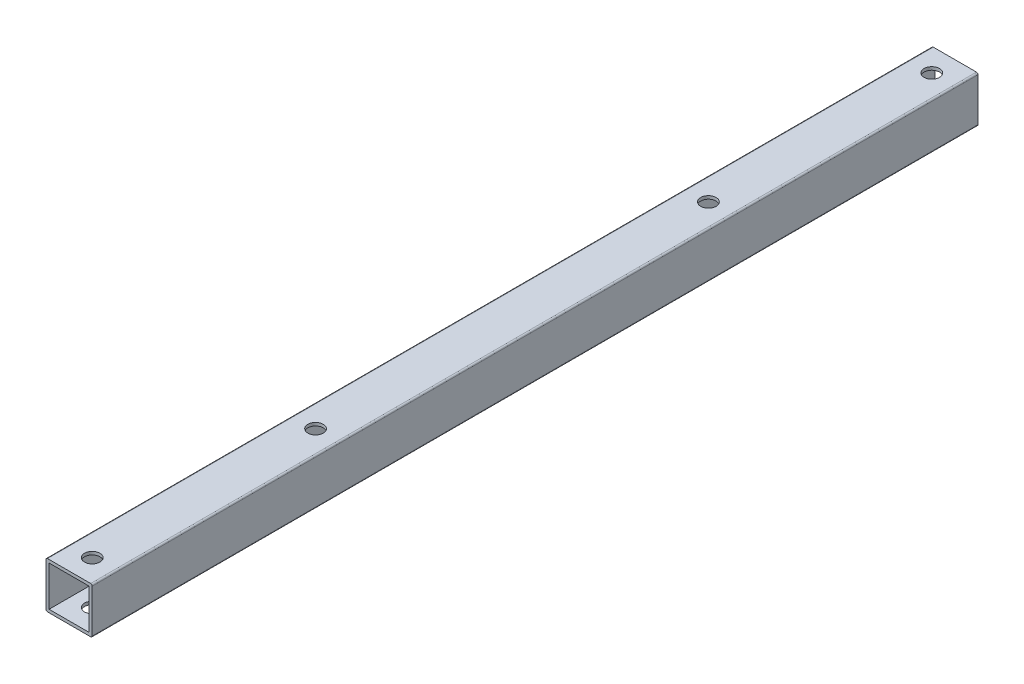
ISO-10303-21;
HEADER;
FILE_DESCRIPTION(('STEP AP214'),'2;1');
FILE_NAME('part.step','',(''),(''),'','','');
FILE_SCHEMA(('AUTOMOTIVE_DESIGN { 1 0 10303 214 1 1 1 1 }'));
ENDSEC;
DATA;
#1=APPLICATION_CONTEXT('core data for automotive mechanical design processes');
#2=APPLICATION_PROTOCOL_DEFINITION('international standard','automotive_design',2000,#1);
#3=PRODUCT_CONTEXT('',#1,'mechanical');
#4=PRODUCT('Part','Part','',(#3));
#5=PRODUCT_RELATED_PRODUCT_CATEGORY('part','',(#4));
#6=PRODUCT_DEFINITION_FORMATION('','',#4);
#7=PRODUCT_DEFINITION_CONTEXT('part definition',#1,'design');
#8=PRODUCT_DEFINITION('design','',#6,#7);
#9=PRODUCT_DEFINITION_SHAPE('','',#8);
#10=(LENGTH_UNIT() NAMED_UNIT(*) SI_UNIT(.MILLI.,.METRE.));
#11=(NAMED_UNIT(*) PLANE_ANGLE_UNIT() SI_UNIT($,.RADIAN.));
#12=(NAMED_UNIT(*) SI_UNIT($,.STERADIAN.) SOLID_ANGLE_UNIT());
#13=UNCERTAINTY_MEASURE_WITH_UNIT(LENGTH_MEASURE(1.E-05),#10,'distance_accuracy_value','');
#14=(GEOMETRIC_REPRESENTATION_CONTEXT(3) GLOBAL_UNCERTAINTY_ASSIGNED_CONTEXT((#13)) GLOBAL_UNIT_ASSIGNED_CONTEXT((#10,
#11,#12)) REPRESENTATION_CONTEXT('',''));
#15=CARTESIAN_POINT('',(0.,0.,0.));
#16=DIRECTION('',(0.,0.,1.));
#17=DIRECTION('',(1.,0.,0.));
#18=AXIS2_PLACEMENT_3D('',#15,#16,#17);
#19=CARTESIAN_POINT('',(-14.,-14.,0.));
#20=DIRECTION('',(0.,0.,-1.));
#21=DIRECTION('',(-1.,0.,0.));
#22=AXIS2_PLACEMENT_3D('',#19,#20,#21);
#23=PLANE('',#22);
#24=CARTESIAN_POINT('',(-14.,-14.,0.));
#25=DIRECTION('',(0.,0.,-1.));
#26=DIRECTION('',(-1.,0.,0.));
#27=AXIS2_PLACEMENT_3D('',#24,#25,#26);
#28=CIRCLE('',#27,0.999999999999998);
#29=CARTESIAN_POINT('',(-14.,-15.,0.));
#30=VERTEX_POINT('',#29);
#31=CARTESIAN_POINT('',(-15.,-14.,0.));
#32=VERTEX_POINT('',#31);
#33=EDGE_CURVE('E127',#30,#32,#28,.T.);
#34=ORIENTED_EDGE('',*,*,#33,.T.);
#35=DIRECTION('',(0.,-1.,0.));
#36=VECTOR('',#35,1.);
#37=CARTESIAN_POINT('',(-15.,14.,0.));
#38=LINE('',#37,#36);
#39=CARTESIAN_POINT('',(-15.,14.,0.));
#40=VERTEX_POINT('',#39);
#41=EDGE_CURVE('E163',#40,#32,#38,.T.);
#42=ORIENTED_EDGE('',*,*,#41,.F.);
#43=CARTESIAN_POINT('',(-14.,14.,0.));
#44=DIRECTION('',(0.,0.,-1.));
#45=DIRECTION('',(-1.,0.,0.));
#46=AXIS2_PLACEMENT_3D('',#43,#44,#45);
#47=CIRCLE('',#46,0.999999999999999);
#48=CARTESIAN_POINT('',(-14.,15.,0.));
#49=VERTEX_POINT('',#48);
#50=EDGE_CURVE('E166',#40,#49,#47,.T.);
#51=ORIENTED_EDGE('',*,*,#50,.T.);
#52=DIRECTION('',(1.,0.,0.));
#53=VECTOR('',#52,1.);
#54=CARTESIAN_POINT('',(-14.,15.,0.));
#55=LINE('',#54,#53);
#56=CARTESIAN_POINT('',(14.,15.,0.));
#57=VERTEX_POINT('',#56);
#58=EDGE_CURVE('E169',#49,#57,#55,.T.);
#59=ORIENTED_EDGE('',*,*,#58,.T.);
#60=CARTESIAN_POINT('',(14.,14.,0.));
#61=DIRECTION('',(0.,0.,1.));
#62=DIRECTION('',(1.,0.,0.));
#63=AXIS2_PLACEMENT_3D('',#60,#61,#62);
#64=CIRCLE('',#63,0.999999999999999);
#65=CARTESIAN_POINT('',(15.,14.,0.));
#66=VERTEX_POINT('',#65);
#67=EDGE_CURVE('E172',#66,#57,#64,.T.);
#68=ORIENTED_EDGE('',*,*,#67,.F.);
#69=DIRECTION('',(0.,1.,0.));
#70=VECTOR('',#69,1.);
#71=CARTESIAN_POINT('',(15.,-14.,0.));
#72=LINE('',#71,#70);
#73=CARTESIAN_POINT('',(15.,-14.,0.));
#74=VERTEX_POINT('',#73);
#75=EDGE_CURVE('E175',#74,#66,#72,.T.);
#76=ORIENTED_EDGE('',*,*,#75,.F.);
#77=CARTESIAN_POINT('',(14.,-14.,0.));
#78=DIRECTION('',(0.,0.,-1.));
#79=DIRECTION('',(-1.,0.,0.));
#80=AXIS2_PLACEMENT_3D('',#77,#78,#79);
#81=CIRCLE('',#80,1.);
#82=CARTESIAN_POINT('',(14.,-15.,0.));
#83=VERTEX_POINT('',#82);
#84=EDGE_CURVE('E177',#74,#83,#81,.T.);
#85=ORIENTED_EDGE('',*,*,#84,.T.);
#86=DIRECTION('',(-1.,0.,0.));
#87=VECTOR('',#86,1.);
#88=CARTESIAN_POINT('',(14.,-15.,0.));
#89=LINE('',#88,#87);
#90=EDGE_CURVE('E180',#83,#30,#89,.T.);
#91=ORIENTED_EDGE('',*,*,#90,.T.);
#92=EDGE_LOOP('',(#34,#42,#51,#59,#68,#76,#85,#91));
#93=FACE_BOUND('',#92,.T.);
#94=DIRECTION('',(1.,0.,0.));
#95=VECTOR('',#94,1.);
#96=CARTESIAN_POINT('',(-14.,13.,0.));
#97=LINE('',#96,#95);
#98=CARTESIAN_POINT('',(-13.,13.,0.));
#99=VERTEX_POINT('',#98);
#100=CARTESIAN_POINT('',(13.,13.,0.));
#101=VERTEX_POINT('',#100);
#102=EDGE_CURVE('E140',#99,#101,#97,.T.);
#103=ORIENTED_EDGE('',*,*,#102,.F.);
#104=DIRECTION('',(0.,-1.,0.));
#105=VECTOR('',#104,1.);
#106=CARTESIAN_POINT('',(-13.,-14.,0.));
#107=LINE('',#106,#105);
#108=CARTESIAN_POINT('',(-13.,-13.,0.));
#109=VERTEX_POINT('',#108);
#110=EDGE_CURVE('E47',#99,#109,#107,.T.);
#111=ORIENTED_EDGE('',*,*,#110,.T.);
#112=DIRECTION('',(-1.,0.,0.));
#113=VECTOR('',#112,1.);
#114=CARTESIAN_POINT('',(-14.,-13.,0.));
#115=LINE('',#114,#113);
#116=CARTESIAN_POINT('',(13.,-13.,0.));
#117=VERTEX_POINT('',#116);
#118=EDGE_CURVE('E131',#117,#109,#115,.T.);
#119=ORIENTED_EDGE('',*,*,#118,.F.);
#120=DIRECTION('',(0.,1.,0.));
#121=VECTOR('',#120,1.);
#122=CARTESIAN_POINT('',(13.,-14.,0.));
#123=LINE('',#122,#121);
#124=EDGE_CURVE('E136',#117,#101,#123,.T.);
#125=ORIENTED_EDGE('',*,*,#124,.T.);
#126=EDGE_LOOP('',(#103,#111,#119,#125));
#127=FACE_BOUND('',#126,.T.);
#128=ADVANCED_FACE('F30',(#93,#127),#23,.T.);
#129=CARTESIAN_POINT('',(-14.,-14.,575.));
#130=DIRECTION('',(0.,0.,-1.));
#131=DIRECTION('',(-1.,0.,0.));
#132=AXIS2_PLACEMENT_3D('',#129,#130,#131);
#133=CYLINDRICAL_SURFACE('',#132,0.999999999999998);
#134=ORIENTED_EDGE('',*,*,#33,.F.);
#135=DIRECTION('',(0.,0.,-1.));
#136=VECTOR('',#135,1.);
#137=CARTESIAN_POINT('',(-14.,-15.,575.));
#138=LINE('',#137,#136);
#139=CARTESIAN_POINT('',(-14.,-15.,575.));
#140=VERTEX_POINT('',#139);
#141=EDGE_CURVE('E11',#140,#30,#138,.T.);
#142=ORIENTED_EDGE('',*,*,#141,.F.);
#143=CARTESIAN_POINT('',(-14.,-14.,575.));
#144=DIRECTION('',(0.,0.,-1.));
#145=DIRECTION('',(-1.,0.,0.));
#146=AXIS2_PLACEMENT_3D('',#143,#144,#145);
#147=CIRCLE('',#146,0.999999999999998);
#148=CARTESIAN_POINT('',(-15.,-14.,575.));
#149=VERTEX_POINT('',#148);
#150=EDGE_CURVE('E183',#140,#149,#147,.T.);
#151=ORIENTED_EDGE('',*,*,#150,.T.);
#152=DIRECTION('',(0.,0.,-1.));
#153=VECTOR('',#152,1.);
#154=CARTESIAN_POINT('',(-15.,-14.,575.));
#155=LINE('',#154,#153);
#156=EDGE_CURVE('E203',#149,#32,#155,.T.);
#157=ORIENTED_EDGE('',*,*,#156,.T.);
#158=EDGE_LOOP('',(#134,#142,#151,#157));
#159=FACE_BOUND('',#158,.T.);
#160=ADVANCED_FACE('F32',(#159),#133,.T.);
#161=CARTESIAN_POINT('',(14.,-15.,575.));
#162=DIRECTION('',(0.,-1.,0.));
#163=DIRECTION('',(1.,0.,0.));
#164=AXIS2_PLACEMENT_3D('',#161,#162,#163);
#165=PLANE('',#164);
#166=CARTESIAN_POINT('',(0.,-15.,415.));
#167=DIRECTION('',(0.,-1.,0.));
#168=DIRECTION('',(1.,0.,0.));
#169=AXIS2_PLACEMENT_3D('',#166,#167,#168);
#170=CIRCLE('',#169,5.);
#171=CARTESIAN_POINT('',(5.,-15.,415.));
#172=VERTEX_POINT('',#171);
#173=EDGE_CURVE('E236',#172,#172,#170,.T.);
#174=ORIENTED_EDGE('',*,*,#173,.F.);
#175=EDGE_LOOP('',(#174));
#176=FACE_BOUND('',#175,.T.);
#177=CARTESIAN_POINT('',(0.,-15.,560.));
#178=DIRECTION('',(0.,-1.,0.));
#179=DIRECTION('',(1.,0.,0.));
#180=AXIS2_PLACEMENT_3D('',#177,#178,#179);
#181=CIRCLE('',#180,5.);
#182=CARTESIAN_POINT('',(5.,-15.,560.));
#183=VERTEX_POINT('',#182);
#184=EDGE_CURVE('E233',#183,#183,#181,.T.);
#185=ORIENTED_EDGE('',*,*,#184,.F.);
#186=EDGE_LOOP('',(#185));
#187=FACE_BOUND('',#186,.T.);
#188=CARTESIAN_POINT('',(0.,-15.,160.));
#189=DIRECTION('',(0.,-1.,0.));
#190=DIRECTION('',(1.,0.,0.));
#191=AXIS2_PLACEMENT_3D('',#188,#189,#190);
#192=CIRCLE('',#191,5.);
#193=CARTESIAN_POINT('',(5.,-15.,160.));
#194=VERTEX_POINT('',#193);
#195=EDGE_CURVE('E251',#194,#194,#192,.T.);
#196=ORIENTED_EDGE('',*,*,#195,.F.);
#197=EDGE_LOOP('',(#196));
#198=FACE_BOUND('',#197,.T.);
#199=CARTESIAN_POINT('',(0.,-15.,15.));
#200=DIRECTION('',(0.,-1.,0.));
#201=DIRECTION('',(1.,0.,0.));
#202=AXIS2_PLACEMENT_3D('',#199,#200,#201);
#203=CIRCLE('',#202,5.);
#204=CARTESIAN_POINT('',(5.,-15.,15.));
#205=VERTEX_POINT('',#204);
#206=EDGE_CURVE('E141',#205,#205,#203,.T.);
#207=ORIENTED_EDGE('',*,*,#206,.F.);
#208=EDGE_LOOP('',(#207));
#209=FACE_BOUND('',#208,.T.);
#210=ORIENTED_EDGE('',*,*,#90,.F.);
#211=DIRECTION('',(0.,0.,-1.));
#212=VECTOR('',#211,1.);
#213=CARTESIAN_POINT('',(14.,-15.,575.));
#214=LINE('',#213,#212);
#215=CARTESIAN_POINT('',(14.,-15.,575.));
#216=VERTEX_POINT('',#215);
#217=EDGE_CURVE('E39',#216,#83,#214,.T.);
#218=ORIENTED_EDGE('',*,*,#217,.F.);
#219=DIRECTION('',(-1.,0.,0.));
#220=VECTOR('',#219,1.);
#221=CARTESIAN_POINT('',(14.,-15.,575.));
#222=LINE('',#221,#220);
#223=EDGE_CURVE('E201',#216,#140,#222,.T.);
#224=ORIENTED_EDGE('',*,*,#223,.T.);
#225=ORIENTED_EDGE('',*,*,#141,.T.);
#226=EDGE_LOOP('',(#210,#218,#224,#225));
#227=FACE_BOUND('',#226,.T.);
#228=ADVANCED_FACE('F281',(#176,#187,#198,#209,#227),#165,.T.);
#229=CARTESIAN_POINT('',(14.,-14.,575.));
#230=DIRECTION('',(0.,0.,-1.));
#231=DIRECTION('',(-1.,0.,0.));
#232=AXIS2_PLACEMENT_3D('',#229,#230,#231);
#233=CYLINDRICAL_SURFACE('',#232,1.);
#234=ORIENTED_EDGE('',*,*,#84,.F.);
#235=DIRECTION('',(0.,0.,-1.));
#236=VECTOR('',#235,1.);
#237=CARTESIAN_POINT('',(15.,-14.,575.));
#238=LINE('',#237,#236);
#239=CARTESIAN_POINT('',(15.,-14.,575.));
#240=VERTEX_POINT('',#239);
#241=EDGE_CURVE('E206',#240,#74,#238,.T.);
#242=ORIENTED_EDGE('',*,*,#241,.F.);
#243=CARTESIAN_POINT('',(14.,-14.,575.));
#244=DIRECTION('',(0.,0.,-1.));
#245=DIRECTION('',(-1.,0.,0.));
#246=AXIS2_PLACEMENT_3D('',#243,#244,#245);
#247=CIRCLE('',#246,1.);
#248=EDGE_CURVE('E198',#240,#216,#247,.T.);
#249=ORIENTED_EDGE('',*,*,#248,.T.);
#250=ORIENTED_EDGE('',*,*,#217,.T.);
#251=EDGE_LOOP('',(#234,#242,#249,#250));
#252=FACE_BOUND('',#251,.T.);
#253=ADVANCED_FACE('F293',(#252),#233,.T.);
#254=CARTESIAN_POINT('',(15.,-14.,575.));
#255=DIRECTION('',(-1.,0.,0.));
#256=DIRECTION('',(0.,-1.,0.));
#257=AXIS2_PLACEMENT_3D('',#254,#255,#256);
#258=PLANE('',#257);
#259=ORIENTED_EDGE('',*,*,#75,.T.);
#260=DIRECTION('',(0.,0.,-1.));
#261=VECTOR('',#260,1.);
#262=CARTESIAN_POINT('',(15.,14.,575.));
#263=LINE('',#262,#261);
#264=CARTESIAN_POINT('',(15.,14.,575.));
#265=VERTEX_POINT('',#264);
#266=EDGE_CURVE('E208',#265,#66,#263,.T.);
#267=ORIENTED_EDGE('',*,*,#266,.F.);
#268=DIRECTION('',(0.,1.,0.));
#269=VECTOR('',#268,1.);
#270=CARTESIAN_POINT('',(15.,-14.,575.));
#271=LINE('',#270,#269);
#272=EDGE_CURVE('E196',#240,#265,#271,.T.);
#273=ORIENTED_EDGE('',*,*,#272,.F.);
#274=ORIENTED_EDGE('',*,*,#241,.T.);
#275=EDGE_LOOP('',(#259,#267,#273,#274));
#276=FACE_BOUND('',#275,.T.);
#277=ADVANCED_FACE('F297',(#276),#258,.F.);
#278=CARTESIAN_POINT('',(14.,14.,575.));
#279=DIRECTION('',(0.,0.,-1.));
#280=DIRECTION('',(-1.,0.,0.));
#281=AXIS2_PLACEMENT_3D('',#278,#279,#280);
#282=CYLINDRICAL_SURFACE('',#281,0.999999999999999);
#283=ORIENTED_EDGE('',*,*,#67,.T.);
#284=DIRECTION('',(0.,0.,-1.));
#285=VECTOR('',#284,1.);
#286=CARTESIAN_POINT('',(14.,15.,575.));
#287=LINE('',#286,#285);
#288=CARTESIAN_POINT('',(14.,15.,575.));
#289=VERTEX_POINT('',#288);
#290=EDGE_CURVE('E211',#289,#57,#287,.T.);
#291=ORIENTED_EDGE('',*,*,#290,.F.);
#292=CARTESIAN_POINT('',(14.,14.,575.));
#293=DIRECTION('',(0.,0.,1.));
#294=DIRECTION('',(1.,0.,0.));
#295=AXIS2_PLACEMENT_3D('',#292,#293,#294);
#296=CIRCLE('',#295,0.999999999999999);
#297=EDGE_CURVE('E194',#265,#289,#296,.T.);
#298=ORIENTED_EDGE('',*,*,#297,.F.);
#299=ORIENTED_EDGE('',*,*,#266,.T.);
#300=EDGE_LOOP('',(#283,#291,#298,#299));
#301=FACE_BOUND('',#300,.T.);
#302=ADVANCED_FACE('F301',(#301),#282,.T.);
#303=CARTESIAN_POINT('',(-14.,15.,575.));
#304=DIRECTION('',(0.,1.,0.));
#305=DIRECTION('',(0.,0.,1.));
#306=AXIS2_PLACEMENT_3D('',#303,#304,#305);
#307=PLANE('',#306);
#308=CARTESIAN_POINT('',(0.,15.,415.));
#309=DIRECTION('',(0.,1.,0.));
#310=DIRECTION('',(0.,0.,1.));
#311=AXIS2_PLACEMENT_3D('',#308,#309,#310);
#312=CIRCLE('',#311,5.);
#313=CARTESIAN_POINT('',(0.,15.,420.));
#314=VERTEX_POINT('',#313);
#315=EDGE_CURVE('E440',#314,#314,#312,.T.);
#316=ORIENTED_EDGE('',*,*,#315,.F.);
#317=EDGE_LOOP('',(#316));
#318=FACE_BOUND('',#317,.T.);
#319=CARTESIAN_POINT('',(0.,15.,560.));
#320=DIRECTION('',(0.,1.,0.));
#321=DIRECTION('',(0.,0.,1.));
#322=AXIS2_PLACEMENT_3D('',#319,#320,#321);
#323=CIRCLE('',#322,5.);
#324=CARTESIAN_POINT('',(0.,15.,565.));
#325=VERTEX_POINT('',#324);
#326=EDGE_CURVE('E229',#325,#325,#323,.T.);
#327=ORIENTED_EDGE('',*,*,#326,.F.);
#328=EDGE_LOOP('',(#327));
#329=FACE_BOUND('',#328,.T.);
#330=CARTESIAN_POINT('',(0.,15.,160.));
#331=DIRECTION('',(0.,1.,0.));
#332=DIRECTION('',(0.,0.,1.));
#333=AXIS2_PLACEMENT_3D('',#330,#331,#332);
#334=CIRCLE('',#333,5.);
#335=CARTESIAN_POINT('',(0.,15.,165.));
#336=VERTEX_POINT('',#335);
#337=EDGE_CURVE('E225',#336,#336,#334,.T.);
#338=ORIENTED_EDGE('',*,*,#337,.F.);
#339=EDGE_LOOP('',(#338));
#340=FACE_BOUND('',#339,.T.);
#341=CARTESIAN_POINT('',(0.,15.,15.));
#342=DIRECTION('',(0.,1.,0.));
#343=DIRECTION('',(0.,0.,1.));
#344=AXIS2_PLACEMENT_3D('',#341,#342,#343);
#345=CIRCLE('',#344,5.);
#346=CARTESIAN_POINT('',(0.,15.,20.));
#347=VERTEX_POINT('',#346);
#348=EDGE_CURVE('E221',#347,#347,#345,.T.);
#349=ORIENTED_EDGE('',*,*,#348,.F.);
#350=EDGE_LOOP('',(#349));
#351=FACE_BOUND('',#350,.T.);
#352=ORIENTED_EDGE('',*,*,#58,.F.);
#353=DIRECTION('',(0.,0.,-1.));
#354=VECTOR('',#353,1.);
#355=CARTESIAN_POINT('',(-14.,15.,575.));
#356=LINE('',#355,#354);
#357=CARTESIAN_POINT('',(-14.,15.,575.));
#358=VERTEX_POINT('',#357);
#359=EDGE_CURVE('E213',#358,#49,#356,.T.);
#360=ORIENTED_EDGE('',*,*,#359,.F.);
#361=DIRECTION('',(1.,0.,0.));
#362=VECTOR('',#361,1.);
#363=CARTESIAN_POINT('',(-14.,15.,575.));
#364=LINE('',#363,#362);
#365=EDGE_CURVE('E191',#358,#289,#364,.T.);
#366=ORIENTED_EDGE('',*,*,#365,.T.);
#367=ORIENTED_EDGE('',*,*,#290,.T.);
#368=EDGE_LOOP('',(#352,#360,#366,#367));
#369=FACE_BOUND('',#368,.T.);
#370=ADVANCED_FACE('F305',(#318,#329,#340,#351,#369),#307,.T.);
#371=CARTESIAN_POINT('',(-14.,14.,575.));
#372=DIRECTION('',(0.,0.,-1.));
#373=DIRECTION('',(-1.,0.,0.));
#374=AXIS2_PLACEMENT_3D('',#371,#372,#373);
#375=CYLINDRICAL_SURFACE('',#374,0.999999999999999);
#376=ORIENTED_EDGE('',*,*,#50,.F.);
#377=DIRECTION('',(0.,0.,-1.));
#378=VECTOR('',#377,1.);
#379=CARTESIAN_POINT('',(-15.,14.,575.));
#380=LINE('',#379,#378);
#381=CARTESIAN_POINT('',(-15.,14.,575.));
#382=VERTEX_POINT('',#381);
#383=EDGE_CURVE('E215',#382,#40,#380,.T.);
#384=ORIENTED_EDGE('',*,*,#383,.F.);
#385=CARTESIAN_POINT('',(-14.,14.,575.));
#386=DIRECTION('',(0.,0.,-1.));
#387=DIRECTION('',(-1.,0.,0.));
#388=AXIS2_PLACEMENT_3D('',#385,#386,#387);
#389=CIRCLE('',#388,0.999999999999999);
#390=EDGE_CURVE('E188',#382,#358,#389,.T.);
#391=ORIENTED_EDGE('',*,*,#390,.T.);
#392=ORIENTED_EDGE('',*,*,#359,.T.);
#393=EDGE_LOOP('',(#376,#384,#391,#392));
#394=FACE_BOUND('',#393,.T.);
#395=ADVANCED_FACE('F309',(#394),#375,.T.);
#396=CARTESIAN_POINT('',(-15.,14.,575.));
#397=DIRECTION('',(1.,0.,0.));
#398=DIRECTION('',(0.,1.,0.));
#399=AXIS2_PLACEMENT_3D('',#396,#397,#398);
#400=PLANE('',#399);
#401=ORIENTED_EDGE('',*,*,#41,.T.);
#402=ORIENTED_EDGE('',*,*,#156,.F.);
#403=DIRECTION('',(0.,-1.,0.));
#404=VECTOR('',#403,1.);
#405=CARTESIAN_POINT('',(-15.,14.,575.));
#406=LINE('',#405,#404);
#407=EDGE_CURVE('E186',#382,#149,#406,.T.);
#408=ORIENTED_EDGE('',*,*,#407,.F.);
#409=ORIENTED_EDGE('',*,*,#383,.T.);
#410=EDGE_LOOP('',(#401,#402,#408,#409));
#411=FACE_BOUND('',#410,.T.);
#412=ADVANCED_FACE('F289',(#411),#400,.F.);
#413=CARTESIAN_POINT('',(-14.,-14.,575.));
#414=DIRECTION('',(0.,0.,-1.));
#415=DIRECTION('',(-1.,0.,0.));
#416=AXIS2_PLACEMENT_3D('',#413,#414,#415);
#417=PLANE('',#416);
#418=DIRECTION('',(0.,1.,0.));
#419=VECTOR('',#418,1.);
#420=CARTESIAN_POINT('',(13.,-14.,575.));
#421=LINE('',#420,#419);
#422=CARTESIAN_POINT('',(13.,-13.,575.));
#423=VERTEX_POINT('',#422);
#424=CARTESIAN_POINT('',(13.,13.,575.));
#425=VERTEX_POINT('',#424);
#426=EDGE_CURVE('E153',#423,#425,#421,.T.);
#427=ORIENTED_EDGE('',*,*,#426,.F.);
#428=DIRECTION('',(-1.,0.,0.));
#429=VECTOR('',#428,1.);
#430=CARTESIAN_POINT('',(-14.,-13.,575.));
#431=LINE('',#430,#429);
#432=CARTESIAN_POINT('',(-13.,-13.,575.));
#433=VERTEX_POINT('',#432);
#434=EDGE_CURVE('E151',#423,#433,#431,.T.);
#435=ORIENTED_EDGE('',*,*,#434,.T.);
#436=DIRECTION('',(0.,-1.,0.));
#437=VECTOR('',#436,1.);
#438=CARTESIAN_POINT('',(-13.,-14.,575.));
#439=LINE('',#438,#437);
#440=CARTESIAN_POINT('',(-13.,13.,575.));
#441=VERTEX_POINT('',#440);
#442=EDGE_CURVE('E123',#441,#433,#439,.T.);
#443=ORIENTED_EDGE('',*,*,#442,.F.);
#444=DIRECTION('',(1.,0.,0.));
#445=VECTOR('',#444,1.);
#446=CARTESIAN_POINT('',(-14.,13.,575.));
#447=LINE('',#446,#445);
#448=EDGE_CURVE('E54',#441,#425,#447,.T.);
#449=ORIENTED_EDGE('',*,*,#448,.T.);
#450=EDGE_LOOP('',(#427,#435,#443,#449));
#451=FACE_BOUND('',#450,.T.);
#452=ORIENTED_EDGE('',*,*,#150,.F.);
#453=ORIENTED_EDGE('',*,*,#223,.F.);
#454=ORIENTED_EDGE('',*,*,#248,.F.);
#455=ORIENTED_EDGE('',*,*,#272,.T.);
#456=ORIENTED_EDGE('',*,*,#297,.T.);
#457=ORIENTED_EDGE('',*,*,#365,.F.);
#458=ORIENTED_EDGE('',*,*,#390,.F.);
#459=ORIENTED_EDGE('',*,*,#407,.T.);
#460=EDGE_LOOP('',(#452,#453,#454,#455,#456,#457,#458,#459));
#461=FACE_BOUND('',#460,.T.);
#462=ADVANCED_FACE('F286',(#451,#461),#417,.F.);
#463=CARTESIAN_POINT('',(-13.,-14.,575.));
#464=DIRECTION('',(1.,0.,0.));
#465=DIRECTION('',(0.,1.,0.));
#466=AXIS2_PLACEMENT_3D('',#463,#464,#465);
#467=PLANE('',#466);
#468=ORIENTED_EDGE('',*,*,#110,.F.);
#469=DIRECTION('',(0.,0.,-1.));
#470=VECTOR('',#469,1.);
#471=CARTESIAN_POINT('',(-13.,13.,575.));
#472=LINE('',#471,#470);
#473=EDGE_CURVE('E156',#441,#99,#472,.T.);
#474=ORIENTED_EDGE('',*,*,#473,.F.);
#475=ORIENTED_EDGE('',*,*,#442,.T.);
#476=DIRECTION('',(0.,0.,-1.));
#477=VECTOR('',#476,1.);
#478=CARTESIAN_POINT('',(-13.,-13.,575.));
#479=LINE('',#478,#477);
#480=EDGE_CURVE('E119',#433,#109,#479,.T.);
#481=ORIENTED_EDGE('',*,*,#480,.T.);
#482=EDGE_LOOP('',(#468,#474,#475,#481));
#483=FACE_BOUND('',#482,.T.);
#484=ADVANCED_FACE('F121',(#483),#467,.T.);
#485=CARTESIAN_POINT('',(-14.,-13.,575.));
#486=DIRECTION('',(0.,-1.,0.));
#487=DIRECTION('',(1.,0.,0.));
#488=AXIS2_PLACEMENT_3D('',#485,#486,#487);
#489=PLANE('',#488);
#490=CARTESIAN_POINT('',(0.,-13.,415.));
#491=DIRECTION('',(0.,-1.,0.));
#492=DIRECTION('',(1.,0.,0.));
#493=AXIS2_PLACEMENT_3D('',#490,#491,#492);
#494=CIRCLE('',#493,5.);
#495=CARTESIAN_POINT('',(5.,-13.,415.));
#496=VERTEX_POINT('',#495);
#497=EDGE_CURVE('E241',#496,#496,#494,.T.);
#498=ORIENTED_EDGE('',*,*,#497,.T.);
#499=EDGE_LOOP('',(#498));
#500=FACE_BOUND('',#499,.T.);
#501=CARTESIAN_POINT('',(0.,-13.,560.));
#502=DIRECTION('',(0.,-1.,0.));
#503=DIRECTION('',(1.,0.,0.));
#504=AXIS2_PLACEMENT_3D('',#501,#502,#503);
#505=CIRCLE('',#504,5.);
#506=CARTESIAN_POINT('',(5.,-13.,560.));
#507=VERTEX_POINT('',#506);
#508=EDGE_CURVE('E228',#507,#507,#505,.T.);
#509=ORIENTED_EDGE('',*,*,#508,.T.);
#510=EDGE_LOOP('',(#509));
#511=FACE_BOUND('',#510,.T.);
#512=CARTESIAN_POINT('',(0.,-13.,160.));
#513=DIRECTION('',(0.,-1.,0.));
#514=DIRECTION('',(1.,0.,0.));
#515=AXIS2_PLACEMENT_3D('',#512,#513,#514);
#516=CIRCLE('',#515,5.);
#517=CARTESIAN_POINT('',(5.,-13.,160.));
#518=VERTEX_POINT('',#517);
#519=EDGE_CURVE('E224',#518,#518,#516,.T.);
#520=ORIENTED_EDGE('',*,*,#519,.T.);
#521=EDGE_LOOP('',(#520));
#522=FACE_BOUND('',#521,.T.);
#523=CARTESIAN_POINT('',(0.,-13.,15.));
#524=DIRECTION('',(0.,-1.,0.));
#525=DIRECTION('',(1.,0.,0.));
#526=AXIS2_PLACEMENT_3D('',#523,#524,#525);
#527=CIRCLE('',#526,5.);
#528=CARTESIAN_POINT('',(5.,-13.,15.));
#529=VERTEX_POINT('',#528);
#530=EDGE_CURVE('E144',#529,#529,#527,.T.);
#531=ORIENTED_EDGE('',*,*,#530,.T.);
#532=EDGE_LOOP('',(#531));
#533=FACE_BOUND('',#532,.T.);
#534=ORIENTED_EDGE('',*,*,#118,.T.);
#535=ORIENTED_EDGE('',*,*,#480,.F.);
#536=ORIENTED_EDGE('',*,*,#434,.F.);
#537=DIRECTION('',(0.,0.,-1.));
#538=VECTOR('',#537,1.);
#539=CARTESIAN_POINT('',(13.,-13.,575.));
#540=LINE('',#539,#538);
#541=EDGE_CURVE('E128',#423,#117,#540,.T.);
#542=ORIENTED_EDGE('',*,*,#541,.T.);
#543=EDGE_LOOP('',(#534,#535,#536,#542));
#544=FACE_BOUND('',#543,.T.);
#545=ADVANCED_FACE('F132',(#500,#511,#522,#533,#544),#489,.F.);
#546=CARTESIAN_POINT('',(13.,-14.,575.));
#547=DIRECTION('',(-1.,0.,0.));
#548=DIRECTION('',(0.,-1.,0.));
#549=AXIS2_PLACEMENT_3D('',#546,#547,#548);
#550=PLANE('',#549);
#551=ORIENTED_EDGE('',*,*,#124,.F.);
#552=ORIENTED_EDGE('',*,*,#541,.F.);
#553=ORIENTED_EDGE('',*,*,#426,.T.);
#554=DIRECTION('',(0.,0.,-1.));
#555=VECTOR('',#554,1.);
#556=CARTESIAN_POINT('',(13.,13.,575.));
#557=LINE('',#556,#555);
#558=EDGE_CURVE('E158',#425,#101,#557,.T.);
#559=ORIENTED_EDGE('',*,*,#558,.T.);
#560=EDGE_LOOP('',(#551,#552,#553,#559));
#561=FACE_BOUND('',#560,.T.);
#562=ADVANCED_FACE('F357',(#561),#550,.T.);
#563=CARTESIAN_POINT('',(-14.,13.,575.));
#564=DIRECTION('',(0.,1.,0.));
#565=DIRECTION('',(0.,0.,1.));
#566=AXIS2_PLACEMENT_3D('',#563,#564,#565);
#567=PLANE('',#566);
#568=CARTESIAN_POINT('',(0.,13.,415.));
#569=DIRECTION('',(0.,1.,0.));
#570=DIRECTION('',(0.,0.,1.));
#571=AXIS2_PLACEMENT_3D('',#568,#569,#570);
#572=CIRCLE('',#571,5.);
#573=CARTESIAN_POINT('',(0.,13.,420.));
#574=VERTEX_POINT('',#573);
#575=EDGE_CURVE('E34',#574,#574,#572,.T.);
#576=ORIENTED_EDGE('',*,*,#575,.T.);
#577=EDGE_LOOP('',(#576));
#578=FACE_BOUND('',#577,.T.);
#579=CARTESIAN_POINT('',(0.,13.,560.));
#580=DIRECTION('',(0.,1.,0.));
#581=DIRECTION('',(0.,0.,1.));
#582=AXIS2_PLACEMENT_3D('',#579,#580,#581);
#583=CIRCLE('',#582,5.);
#584=CARTESIAN_POINT('',(0.,13.,565.));
#585=VERTEX_POINT('',#584);
#586=EDGE_CURVE('E226',#585,#585,#583,.T.);
#587=ORIENTED_EDGE('',*,*,#586,.T.);
#588=EDGE_LOOP('',(#587));
#589=FACE_BOUND('',#588,.T.);
#590=CARTESIAN_POINT('',(0.,13.,160.));
#591=DIRECTION('',(0.,1.,0.));
#592=DIRECTION('',(0.,0.,1.));
#593=AXIS2_PLACEMENT_3D('',#590,#591,#592);
#594=CIRCLE('',#593,5.);
#595=CARTESIAN_POINT('',(0.,13.,165.));
#596=VERTEX_POINT('',#595);
#597=EDGE_CURVE('E222',#596,#596,#594,.T.);
#598=ORIENTED_EDGE('',*,*,#597,.T.);
#599=EDGE_LOOP('',(#598));
#600=FACE_BOUND('',#599,.T.);
#601=CARTESIAN_POINT('',(0.,13.,15.));
#602=DIRECTION('',(0.,1.,0.));
#603=DIRECTION('',(0.,0.,1.));
#604=AXIS2_PLACEMENT_3D('',#601,#602,#603);
#605=CIRCLE('',#604,5.);
#606=CARTESIAN_POINT('',(0.,13.,20.));
#607=VERTEX_POINT('',#606);
#608=EDGE_CURVE('E218',#607,#607,#605,.T.);
#609=ORIENTED_EDGE('',*,*,#608,.T.);
#610=EDGE_LOOP('',(#609));
#611=FACE_BOUND('',#610,.T.);
#612=ORIENTED_EDGE('',*,*,#102,.T.);
#613=ORIENTED_EDGE('',*,*,#558,.F.);
#614=ORIENTED_EDGE('',*,*,#448,.F.);
#615=ORIENTED_EDGE('',*,*,#473,.T.);
#616=EDGE_LOOP('',(#612,#613,#614,#615));
#617=FACE_BOUND('',#616,.T.);
#618=ADVANCED_FACE('F272',(#578,#589,#600,#611,#617),#567,.F.);
#619=CARTESIAN_POINT('',(0.,-20.,15.));
#620=DIRECTION('',(0.,1.,0.));
#621=DIRECTION('',(0.,0.,1.));
#622=AXIS2_PLACEMENT_3D('',#619,#620,#621);
#623=CYLINDRICAL_SURFACE('',#622,5.);
#624=ORIENTED_EDGE('',*,*,#348,.T.);
#625=EDGE_LOOP('',(#624));
#626=FACE_BOUND('',#625,.T.);
#627=ORIENTED_EDGE('',*,*,#608,.F.);
#628=EDGE_LOOP('',(#627));
#629=FACE_BOUND('',#628,.T.);
#630=ADVANCED_FACE('F262',(#626,#629),#623,.F.);
#631=ORIENTED_EDGE('',*,*,#206,.T.);
#632=EDGE_LOOP('',(#631));
#633=FACE_BOUND('',#632,.T.);
#634=ORIENTED_EDGE('',*,*,#530,.F.);
#635=EDGE_LOOP('',(#634));
#636=FACE_BOUND('',#635,.T.);
#637=ADVANCED_FACE('F259',(#633,#636),#623,.F.);
#638=CARTESIAN_POINT('',(0.,-20.,160.));
#639=DIRECTION('',(0.,1.,0.));
#640=DIRECTION('',(0.,0.,1.));
#641=AXIS2_PLACEMENT_3D('',#638,#639,#640);
#642=CYLINDRICAL_SURFACE('',#641,5.);
#643=ORIENTED_EDGE('',*,*,#337,.T.);
#644=EDGE_LOOP('',(#643));
#645=FACE_BOUND('',#644,.T.);
#646=ORIENTED_EDGE('',*,*,#597,.F.);
#647=EDGE_LOOP('',(#646));
#648=FACE_BOUND('',#647,.T.);
#649=ADVANCED_FACE('F261',(#645,#648),#642,.F.);
#650=ORIENTED_EDGE('',*,*,#195,.T.);
#651=EDGE_LOOP('',(#650));
#652=FACE_BOUND('',#651,.T.);
#653=ORIENTED_EDGE('',*,*,#519,.F.);
#654=EDGE_LOOP('',(#653));
#655=FACE_BOUND('',#654,.T.);
#656=ADVANCED_FACE('F269',(#652,#655),#642,.F.);
#657=CARTESIAN_POINT('',(0.,-20.,560.));
#658=DIRECTION('',(0.,1.,0.));
#659=DIRECTION('',(0.,0.,1.));
#660=AXIS2_PLACEMENT_3D('',#657,#658,#659);
#661=CYLINDRICAL_SURFACE('',#660,5.);
#662=ORIENTED_EDGE('',*,*,#326,.T.);
#663=EDGE_LOOP('',(#662));
#664=FACE_BOUND('',#663,.T.);
#665=ORIENTED_EDGE('',*,*,#586,.F.);
#666=EDGE_LOOP('',(#665));
#667=FACE_BOUND('',#666,.T.);
#668=ADVANCED_FACE('F395',(#664,#667),#661,.F.);
#669=ORIENTED_EDGE('',*,*,#184,.T.);
#670=EDGE_LOOP('',(#669));
#671=FACE_BOUND('',#670,.T.);
#672=ORIENTED_EDGE('',*,*,#508,.F.);
#673=EDGE_LOOP('',(#672));
#674=FACE_BOUND('',#673,.T.);
#675=ADVANCED_FACE('F404',(#671,#674),#661,.F.);
#676=CARTESIAN_POINT('',(0.,-20.,415.));
#677=DIRECTION('',(0.,1.,0.));
#678=DIRECTION('',(0.,0.,1.));
#679=AXIS2_PLACEMENT_3D('',#676,#677,#678);
#680=CYLINDRICAL_SURFACE('',#679,5.);
#681=ORIENTED_EDGE('',*,*,#315,.T.);
#682=EDGE_LOOP('',(#681));
#683=FACE_BOUND('',#682,.T.);
#684=ORIENTED_EDGE('',*,*,#575,.F.);
#685=EDGE_LOOP('',(#684));
#686=FACE_BOUND('',#685,.T.);
#687=ADVANCED_FACE('F413',(#683,#686),#680,.F.);
#688=ORIENTED_EDGE('',*,*,#173,.T.);
#689=EDGE_LOOP('',(#688));
#690=FACE_BOUND('',#689,.T.);
#691=ORIENTED_EDGE('',*,*,#497,.F.);
#692=EDGE_LOOP('',(#691));
#693=FACE_BOUND('',#692,.T.);
#694=ADVANCED_FACE('F422',(#690,#693),#680,.F.);
#695=CLOSED_SHELL('',(#128,#160,#228,#253,#277,#302,#370,#395,#412,#462,#484,#545,#562,#618,
#630,#637,#649,#656,#668,#675,#687,#694));
#696=MANIFOLD_SOLID_BREP('B2',#695);
#697=ADVANCED_BREP_SHAPE_REPRESENTATION('',(#18,#696),#14);
#698=SHAPE_DEFINITION_REPRESENTATION(#9,#697);
ENDSEC;
END-ISO-10303-21;
